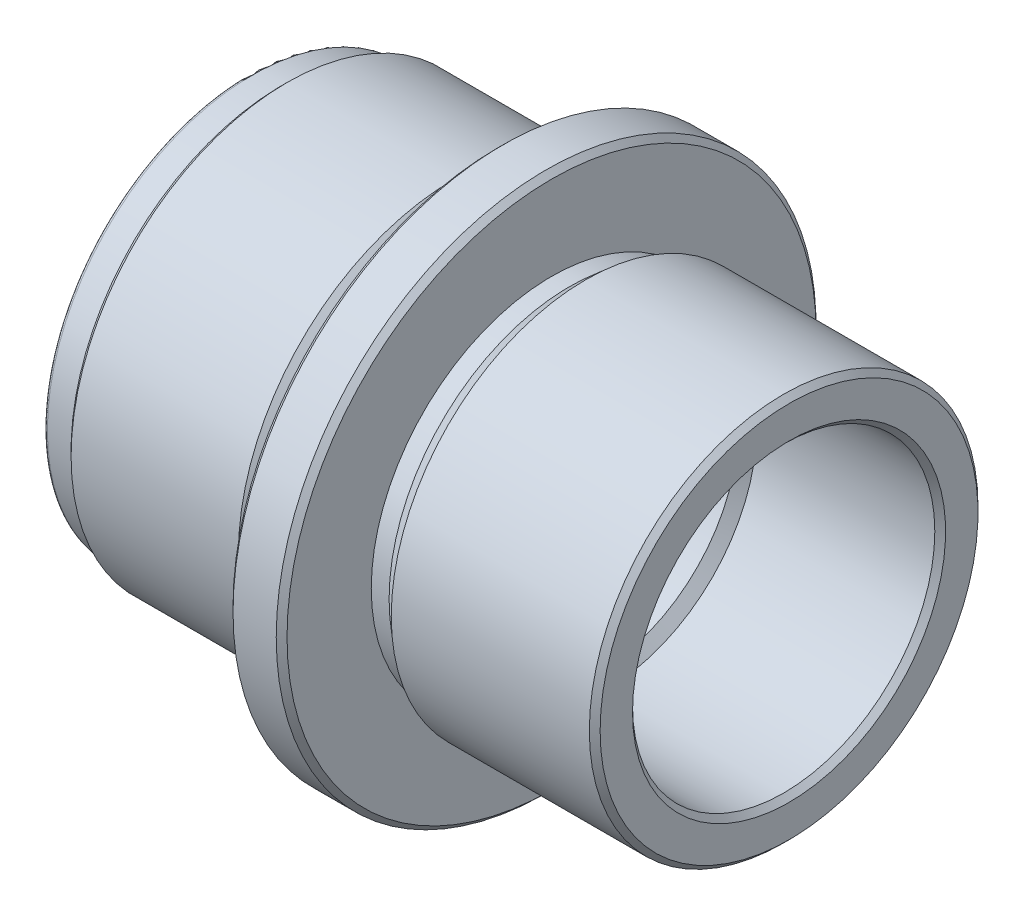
ISO-10303-21;
HEADER;
FILE_DESCRIPTION(('STEP AP214'),'2;1');
FILE_NAME('part.step','',(''),(''),'','','');
FILE_SCHEMA(('AUTOMOTIVE_DESIGN { 1 0 10303 214 1 1 1 1 }'));
ENDSEC;
DATA;
#1=APPLICATION_CONTEXT('core data for automotive mechanical design processes');
#2=APPLICATION_PROTOCOL_DEFINITION('international standard','automotive_design',2000,#1);
#3=PRODUCT_CONTEXT('',#1,'mechanical');
#4=PRODUCT('Part','Part','',(#3));
#5=PRODUCT_RELATED_PRODUCT_CATEGORY('part','',(#4));
#6=PRODUCT_DEFINITION_FORMATION('','',#4);
#7=PRODUCT_DEFINITION_CONTEXT('part definition',#1,'design');
#8=PRODUCT_DEFINITION('design','',#6,#7);
#9=PRODUCT_DEFINITION_SHAPE('','',#8);
#10=(LENGTH_UNIT() NAMED_UNIT(*) SI_UNIT(.MILLI.,.METRE.));
#11=(NAMED_UNIT(*) PLANE_ANGLE_UNIT() SI_UNIT($,.RADIAN.));
#12=(NAMED_UNIT(*) SI_UNIT($,.STERADIAN.) SOLID_ANGLE_UNIT());
#13=UNCERTAINTY_MEASURE_WITH_UNIT(LENGTH_MEASURE(1.E-05),#10,'distance_accuracy_value','');
#14=(GEOMETRIC_REPRESENTATION_CONTEXT(3) GLOBAL_UNCERTAINTY_ASSIGNED_CONTEXT((#13)) GLOBAL_UNIT_ASSIGNED_CONTEXT((#10,
#11,#12)) REPRESENTATION_CONTEXT('',''));
#15=CARTESIAN_POINT('',(0.,0.,0.));
#16=DIRECTION('',(0.,0.,1.));
#17=DIRECTION('',(1.,0.,0.));
#18=AXIS2_PLACEMENT_3D('',#15,#16,#17);
#19=CARTESIAN_POINT('',(0.,0.,0.));
#20=DIRECTION('',(-1.,0.,0.));
#21=DIRECTION('',(0.,0.,1.));
#22=AXIS2_PLACEMENT_3D('',#19,#20,#21);
#23=CYLINDRICAL_SURFACE('',#22,35.5600000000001);
#24=CARTESIAN_POINT('',(1.27000000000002,0.,0.));
#25=DIRECTION('',(1.,0.,0.));
#26=DIRECTION('',(0.,0.,-1.));
#27=AXIS2_PLACEMENT_3D('',#24,#25,#26);
#28=CIRCLE('',#27,35.5600000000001);
#29=CARTESIAN_POINT('',(1.27000000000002,0.,-35.5600000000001));
#30=VERTEX_POINT('',#29);
#31=EDGE_CURVE('E76',#30,#30,#28,.F.);
#32=ORIENTED_EDGE('',*,*,#31,.T.);
#33=EDGE_LOOP('',(#32));
#34=FACE_BOUND('',#33,.T.);
#35=CARTESIAN_POINT('',(10.16,0.,0.));
#36=DIRECTION('',(-1.,0.,0.));
#37=DIRECTION('',(0.,0.,1.));
#38=AXIS2_PLACEMENT_3D('',#35,#36,#37);
#39=CIRCLE('',#38,35.5600000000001);
#40=CARTESIAN_POINT('',(10.16,0.,35.5600000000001));
#41=VERTEX_POINT('',#40);
#42=EDGE_CURVE('E148',#41,#41,#39,.T.);
#43=ORIENTED_EDGE('',*,*,#42,.F.);
#44=EDGE_LOOP('',(#43));
#45=FACE_BOUND('',#44,.T.);
#46=ADVANCED_FACE('F49',(#34,#45),#23,.F.);
#47=CARTESIAN_POINT('',(0.,35.5600000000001,0.));
#48=DIRECTION('',(1.,0.,0.));
#49=DIRECTION('',(0.,0.,-1.));
#50=AXIS2_PLACEMENT_3D('',#47,#48,#49);
#51=PLANE('',#50);
#52=CARTESIAN_POINT('',(0.,0.,0.));
#53=DIRECTION('',(1.,0.,0.));
#54=DIRECTION('',(0.,0.,-1.));
#55=AXIS2_PLACEMENT_3D('',#52,#53,#54);
#56=CIRCLE('',#55,47.498);
#57=CARTESIAN_POINT('',(0.,0.,-47.498));
#58=VERTEX_POINT('',#57);
#59=EDGE_CURVE('E57',#58,#58,#56,.F.);
#60=ORIENTED_EDGE('',*,*,#59,.T.);
#61=EDGE_LOOP('',(#60));
#62=FACE_BOUND('',#61,.T.);
#63=CARTESIAN_POINT('',(0.,0.,0.));
#64=DIRECTION('',(1.,0.,0.));
#65=DIRECTION('',(0.,0.,-1.));
#66=AXIS2_PLACEMENT_3D('',#63,#64,#65);
#67=CIRCLE('',#66,36.8300000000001);
#68=CARTESIAN_POINT('',(0.,0.,-36.8300000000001));
#69=VERTEX_POINT('',#68);
#70=EDGE_CURVE('E73',#69,#69,#67,.T.);
#71=ORIENTED_EDGE('',*,*,#70,.T.);
#72=EDGE_LOOP('',(#71));
#73=FACE_BOUND('',#72,.T.);
#74=ADVANCED_FACE('F155',(#62,#73),#51,.F.);
#75=CARTESIAN_POINT('',(0.,0.,0.));
#76=DIRECTION('',(-1.,0.,0.));
#77=DIRECTION('',(0.,0.,1.));
#78=AXIS2_PLACEMENT_3D('',#75,#76,#77);
#79=CYLINDRICAL_SURFACE('',#78,48.26);
#80=CARTESIAN_POINT('',(0.762,0.,0.));
#81=DIRECTION('',(1.,0.,0.));
#82=DIRECTION('',(0.,0.,-1.));
#83=AXIS2_PLACEMENT_3D('',#80,#81,#82);
#84=CIRCLE('',#83,48.26);
#85=CARTESIAN_POINT('',(0.762,0.,-48.26));
#86=VERTEX_POINT('',#85);
#87=EDGE_CURVE('E12',#86,#86,#84,.T.);
#88=ORIENTED_EDGE('',*,*,#87,.T.);
#89=EDGE_LOOP('',(#88));
#90=FACE_BOUND('',#89,.T.);
#91=CARTESIAN_POINT('',(7.62,0.,0.));
#92=DIRECTION('',(-1.,0.,0.));
#93=DIRECTION('',(0.,0.,1.));
#94=AXIS2_PLACEMENT_3D('',#91,#92,#93);
#95=CIRCLE('',#94,48.26);
#96=CARTESIAN_POINT('',(7.62,0.,48.26));
#97=VERTEX_POINT('',#96);
#98=EDGE_CURVE('E109',#97,#97,#95,.T.);
#99=ORIENTED_EDGE('',*,*,#98,.T.);
#100=EDGE_LOOP('',(#99));
#101=FACE_BOUND('',#100,.T.);
#102=ADVANCED_FACE('F160',(#90,#101),#79,.T.);
#103=CARTESIAN_POINT('',(7.62,48.26,0.));
#104=DIRECTION('',(1.,0.,0.));
#105=DIRECTION('',(0.,0.,-1.));
#106=AXIS2_PLACEMENT_3D('',#103,#104,#105);
#107=PLANE('',#106);
#108=CARTESIAN_POINT('',(7.62,0.,0.));
#109=DIRECTION('',(1.,0.,0.));
#110=DIRECTION('',(0.,0.,-1.));
#111=AXIS2_PLACEMENT_3D('',#108,#109,#110);
#112=CIRCLE('',#111,49.53);
#113=CARTESIAN_POINT('',(7.62,0.,-49.53));
#114=VERTEX_POINT('',#113);
#115=EDGE_CURVE('E106',#114,#114,#112,.F.);
#116=ORIENTED_EDGE('',*,*,#115,.T.);
#117=EDGE_LOOP('',(#116));
#118=FACE_BOUND('',#117,.T.);
#119=ORIENTED_EDGE('',*,*,#98,.F.);
#120=EDGE_LOOP('',(#119));
#121=FACE_BOUND('',#120,.T.);
#122=ADVANCED_FACE('F267',(#118,#121),#107,.F.);
#123=CARTESIAN_POINT('',(0.,0.,0.));
#124=DIRECTION('',(-1.,0.,0.));
#125=DIRECTION('',(0.,0.,1.));
#126=AXIS2_PLACEMENT_3D('',#123,#124,#125);
#127=CYLINDRICAL_SURFACE('',#126,50.8);
#128=CARTESIAN_POINT('',(8.89000000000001,0.,0.));
#129=DIRECTION('',(1.,0.,0.));
#130=DIRECTION('',(0.,0.,-1.));
#131=AXIS2_PLACEMENT_3D('',#128,#129,#130);
#132=CIRCLE('',#131,50.8);
#133=CARTESIAN_POINT('',(8.89000000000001,0.,-50.8));
#134=VERTEX_POINT('',#133);
#135=EDGE_CURVE('E103',#134,#134,#132,.T.);
#136=ORIENTED_EDGE('',*,*,#135,.T.);
#137=EDGE_LOOP('',(#136));
#138=FACE_BOUND('',#137,.T.);
#139=CARTESIAN_POINT('',(48.26,0.,0.));
#140=DIRECTION('',(-1.,0.,0.));
#141=DIRECTION('',(0.,0.,1.));
#142=AXIS2_PLACEMENT_3D('',#139,#140,#141);
#143=CIRCLE('',#142,50.8);
#144=CARTESIAN_POINT('',(48.26,0.,50.8));
#145=VERTEX_POINT('',#144);
#146=EDGE_CURVE('E112',#145,#145,#143,.T.);
#147=ORIENTED_EDGE('',*,*,#146,.T.);
#148=EDGE_LOOP('',(#147));
#149=FACE_BOUND('',#148,.T.);
#150=ADVANCED_FACE('F263',(#138,#149),#127,.T.);
#151=CARTESIAN_POINT('',(50.8,0.,0.));
#152=DIRECTION('',(-1.,0.,0.));
#153=DIRECTION('',(0.,0.,1.));
#154=AXIS2_PLACEMENT_3D('',#151,#152,#153);
#155=CONICAL_SURFACE('',#154,48.26,0.785398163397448);
#156=ORIENTED_EDGE('',*,*,#146,.F.);
#157=EDGE_LOOP('',(#156));
#158=FACE_BOUND('',#157,.T.);
#159=CARTESIAN_POINT('',(50.8,0.,0.));
#160=DIRECTION('',(-1.,0.,0.));
#161=DIRECTION('',(0.,0.,1.));
#162=AXIS2_PLACEMENT_3D('',#159,#160,#161);
#163=CIRCLE('',#162,48.26);
#164=CARTESIAN_POINT('',(50.8,0.,48.26));
#165=VERTEX_POINT('',#164);
#166=EDGE_CURVE('E115',#165,#165,#163,.T.);
#167=ORIENTED_EDGE('',*,*,#166,.T.);
#168=EDGE_LOOP('',(#167));
#169=FACE_BOUND('',#168,.T.);
#170=ADVANCED_FACE('F259',(#158,#169),#155,.T.);
#171=CARTESIAN_POINT('',(0.,0.,0.));
#172=DIRECTION('',(-1.,0.,0.));
#173=DIRECTION('',(0.,0.,1.));
#174=AXIS2_PLACEMENT_3D('',#171,#172,#173);
#175=CYLINDRICAL_SURFACE('',#174,48.26);
#176=ORIENTED_EDGE('',*,*,#166,.F.);
#177=EDGE_LOOP('',(#176));
#178=FACE_BOUND('',#177,.T.);
#179=CARTESIAN_POINT('',(58.42,0.,0.));
#180=DIRECTION('',(-1.,0.,0.));
#181=DIRECTION('',(0.,0.,1.));
#182=AXIS2_PLACEMENT_3D('',#179,#180,#181);
#183=CIRCLE('',#182,48.26);
#184=CARTESIAN_POINT('',(58.42,0.,48.26));
#185=VERTEX_POINT('',#184);
#186=EDGE_CURVE('E118',#185,#185,#183,.T.);
#187=ORIENTED_EDGE('',*,*,#186,.T.);
#188=EDGE_LOOP('',(#187));
#189=FACE_BOUND('',#188,.T.);
#190=ADVANCED_FACE('F255',(#178,#189),#175,.T.);
#191=CARTESIAN_POINT('',(58.42,48.26,0.));
#192=DIRECTION('',(1.,0.,0.));
#193=DIRECTION('',(0.,0.,-1.));
#194=AXIS2_PLACEMENT_3D('',#191,#192,#193);
#195=PLANE('',#194);
#196=CARTESIAN_POINT('',(58.42,0.,0.));
#197=DIRECTION('',(1.,0.,0.));
#198=DIRECTION('',(0.,0.,-1.));
#199=AXIS2_PLACEMENT_3D('',#196,#197,#198);
#200=CIRCLE('',#199,62.23);
#201=CARTESIAN_POINT('',(58.42,0.,-62.23));
#202=VERTEX_POINT('',#201);
#203=EDGE_CURVE('E100',#202,#202,#200,.F.);
#204=ORIENTED_EDGE('',*,*,#203,.T.);
#205=EDGE_LOOP('',(#204));
#206=FACE_BOUND('',#205,.T.);
#207=ORIENTED_EDGE('',*,*,#186,.F.);
#208=EDGE_LOOP('',(#207));
#209=FACE_BOUND('',#208,.T.);
#210=ADVANCED_FACE('F251',(#206,#209),#195,.F.);
#211=CARTESIAN_POINT('',(0.,0.,0.));
#212=DIRECTION('',(-1.,0.,0.));
#213=DIRECTION('',(0.,0.,1.));
#214=AXIS2_PLACEMENT_3D('',#211,#212,#213);
#215=CYLINDRICAL_SURFACE('',#214,63.5);
#216=CARTESIAN_POINT('',(59.69,0.,0.));
#217=DIRECTION('',(1.,0.,0.));
#218=DIRECTION('',(0.,0.,-1.));
#219=AXIS2_PLACEMENT_3D('',#216,#217,#218);
#220=CIRCLE('',#219,63.5);
#221=CARTESIAN_POINT('',(59.69,0.,-63.5));
#222=VERTEX_POINT('',#221);
#223=EDGE_CURVE('E94',#222,#222,#220,.T.);
#224=ORIENTED_EDGE('',*,*,#223,.T.);
#225=EDGE_LOOP('',(#224));
#226=FACE_BOUND('',#225,.T.);
#227=CARTESIAN_POINT('',(69.8499999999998,0.,0.));
#228=DIRECTION('',(-1.,0.,0.));
#229=DIRECTION('',(0.,0.,1.));
#230=AXIS2_PLACEMENT_3D('',#227,#228,#229);
#231=CIRCLE('',#230,63.5);
#232=CARTESIAN_POINT('',(69.8499999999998,0.,63.5));
#233=VERTEX_POINT('',#232);
#234=EDGE_CURVE('E97',#233,#233,#231,.T.);
#235=ORIENTED_EDGE('',*,*,#234,.T.);
#236=EDGE_LOOP('',(#235));
#237=FACE_BOUND('',#236,.T.);
#238=ADVANCED_FACE('F247',(#226,#237),#215,.T.);
#239=CARTESIAN_POINT('',(71.1199999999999,63.5,0.));
#240=DIRECTION('',(-1.,0.,0.));
#241=DIRECTION('',(0.,0.,1.));
#242=AXIS2_PLACEMENT_3D('',#239,#240,#241);
#243=PLANE('',#242);
#244=CARTESIAN_POINT('',(71.1199999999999,0.,0.));
#245=DIRECTION('',(-1.,0.,0.));
#246=DIRECTION('',(0.,0.,1.));
#247=AXIS2_PLACEMENT_3D('',#244,#245,#246);
#248=CIRCLE('',#247,62.23);
#249=CARTESIAN_POINT('',(71.1199999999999,0.,62.23));
#250=VERTEX_POINT('',#249);
#251=EDGE_CURVE('E91',#250,#250,#248,.F.);
#252=ORIENTED_EDGE('',*,*,#251,.T.);
#253=EDGE_LOOP('',(#252));
#254=FACE_BOUND('',#253,.T.);
#255=CARTESIAN_POINT('',(71.1199999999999,0.,0.));
#256=DIRECTION('',(-1.,0.,0.));
#257=DIRECTION('',(0.,0.,1.));
#258=AXIS2_PLACEMENT_3D('',#255,#256,#257);
#259=CIRCLE('',#258,42.4161080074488);
#260=CARTESIAN_POINT('',(71.1199999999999,0.,42.4161080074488));
#261=VERTEX_POINT('',#260);
#262=EDGE_CURVE('E121',#261,#261,#259,.T.);
#263=ORIENTED_EDGE('',*,*,#262,.T.);
#264=EDGE_LOOP('',(#263));
#265=FACE_BOUND('',#264,.T.);
#266=ADVANCED_FACE('F243',(#254,#265),#243,.F.);
#267=CARTESIAN_POINT('',(0.,0.,0.));
#268=DIRECTION('',(-1.,0.,0.));
#269=DIRECTION('',(0.,0.,1.));
#270=AXIS2_PLACEMENT_3D('',#267,#268,#269);
#271=CYLINDRICAL_SURFACE('',#270,42.4161080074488);
#272=ORIENTED_EDGE('',*,*,#262,.F.);
#273=EDGE_LOOP('',(#272));
#274=FACE_BOUND('',#273,.T.);
#275=CARTESIAN_POINT('',(75.319090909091,0.,0.));
#276=DIRECTION('',(-1.,0.,0.));
#277=DIRECTION('',(0.,0.,1.));
#278=AXIS2_PLACEMENT_3D('',#275,#276,#277);
#279=CIRCLE('',#278,42.4161080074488);
#280=CARTESIAN_POINT('',(75.319090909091,0.,42.4161080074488));
#281=VERTEX_POINT('',#280);
#282=EDGE_CURVE('E124',#281,#281,#279,.T.);
#283=ORIENTED_EDGE('',*,*,#282,.T.);
#284=EDGE_LOOP('',(#283));
#285=FACE_BOUND('',#284,.T.);
#286=ADVANCED_FACE('F239',(#274,#285),#271,.T.);
#287=CARTESIAN_POINT('',(79.1290909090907,0.,0.));
#288=DIRECTION('',(1.,0.,0.));
#289=DIRECTION('',(0.,0.,-1.));
#290=AXIS2_PLACEMENT_3D('',#287,#288,#289);
#291=CONICAL_SURFACE('',#290,45.72,0.714374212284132);
#292=ORIENTED_EDGE('',*,*,#282,.F.);
#293=EDGE_LOOP('',(#292));
#294=FACE_BOUND('',#293,.T.);
#295=CARTESIAN_POINT('',(79.1290909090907,0.,0.));
#296=DIRECTION('',(-1.,0.,0.));
#297=DIRECTION('',(0.,0.,1.));
#298=AXIS2_PLACEMENT_3D('',#295,#296,#297);
#299=CIRCLE('',#298,45.72);
#300=CARTESIAN_POINT('',(79.1290909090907,0.,45.72));
#301=VERTEX_POINT('',#300);
#302=EDGE_CURVE('E127',#301,#301,#299,.T.);
#303=ORIENTED_EDGE('',*,*,#302,.T.);
#304=EDGE_LOOP('',(#303));
#305=FACE_BOUND('',#304,.T.);
#306=ADVANCED_FACE('F235',(#294,#305),#291,.T.);
#307=CARTESIAN_POINT('',(0.,0.,0.));
#308=DIRECTION('',(-1.,0.,0.));
#309=DIRECTION('',(0.,0.,1.));
#310=AXIS2_PLACEMENT_3D('',#307,#308,#309);
#311=CYLINDRICAL_SURFACE('',#310,45.72);
#312=CARTESIAN_POINT('',(125.73,0.,0.));
#313=DIRECTION('',(-1.,0.,0.));
#314=DIRECTION('',(0.,0.,1.));
#315=AXIS2_PLACEMENT_3D('',#312,#313,#314);
#316=CIRCLE('',#315,45.72);
#317=CARTESIAN_POINT('',(125.73,0.,45.72));
#318=VERTEX_POINT('',#317);
#319=EDGE_CURVE('E88',#318,#318,#316,.T.);
#320=ORIENTED_EDGE('',*,*,#319,.T.);
#321=EDGE_LOOP('',(#320));
#322=FACE_BOUND('',#321,.T.);
#323=ORIENTED_EDGE('',*,*,#302,.F.);
#324=EDGE_LOOP('',(#323));
#325=FACE_BOUND('',#324,.T.);
#326=ADVANCED_FACE('F231',(#322,#325),#311,.T.);
#327=CARTESIAN_POINT('',(127.,45.72,0.));
#328=DIRECTION('',(-1.,0.,0.));
#329=DIRECTION('',(0.,0.,1.));
#330=AXIS2_PLACEMENT_3D('',#327,#328,#329);
#331=PLANE('',#330);
#332=CARTESIAN_POINT('',(127.,0.,0.));
#333=DIRECTION('',(-1.,0.,0.));
#334=DIRECTION('',(0.,0.,1.));
#335=AXIS2_PLACEMENT_3D('',#332,#333,#334);
#336=CIRCLE('',#335,44.45);
#337=CARTESIAN_POINT('',(127.,0.,44.45));
#338=VERTEX_POINT('',#337);
#339=EDGE_CURVE('E82',#338,#338,#336,.F.);
#340=ORIENTED_EDGE('',*,*,#339,.T.);
#341=EDGE_LOOP('',(#340));
#342=FACE_BOUND('',#341,.T.);
#343=CARTESIAN_POINT('',(127.,0.,0.));
#344=DIRECTION('',(-1.,0.,0.));
#345=DIRECTION('',(0.,0.,1.));
#346=AXIS2_PLACEMENT_3D('',#343,#344,#345);
#347=CIRCLE('',#346,36.8300000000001);
#348=CARTESIAN_POINT('',(127.,0.,36.8300000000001));
#349=VERTEX_POINT('',#348);
#350=EDGE_CURVE('E85',#349,#349,#347,.T.);
#351=ORIENTED_EDGE('',*,*,#350,.T.);
#352=EDGE_LOOP('',(#351));
#353=FACE_BOUND('',#352,.T.);
#354=ADVANCED_FACE('F227',(#342,#353),#331,.F.);
#355=CARTESIAN_POINT('',(0.,0.,0.));
#356=DIRECTION('',(-1.,0.,0.));
#357=DIRECTION('',(0.,0.,1.));
#358=AXIS2_PLACEMENT_3D('',#355,#356,#357);
#359=CYLINDRICAL_SURFACE('',#358,35.5600000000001);
#360=CARTESIAN_POINT('',(125.73,0.,0.));
#361=DIRECTION('',(-1.,0.,0.));
#362=DIRECTION('',(0.,0.,1.));
#363=AXIS2_PLACEMENT_3D('',#360,#361,#362);
#364=CIRCLE('',#363,35.5600000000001);
#365=CARTESIAN_POINT('',(125.73,0.,35.5600000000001));
#366=VERTEX_POINT('',#365);
#367=EDGE_CURVE('E79',#366,#366,#364,.F.);
#368=ORIENTED_EDGE('',*,*,#367,.T.);
#369=EDGE_LOOP('',(#368));
#370=FACE_BOUND('',#369,.T.);
#371=CARTESIAN_POINT('',(83.8200000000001,0.,0.));
#372=DIRECTION('',(-1.,0.,0.));
#373=DIRECTION('',(0.,0.,1.));
#374=AXIS2_PLACEMENT_3D('',#371,#372,#373);
#375=CIRCLE('',#374,35.5600000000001);
#376=CARTESIAN_POINT('',(83.8200000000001,0.,35.5600000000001));
#377=VERTEX_POINT('',#376);
#378=EDGE_CURVE('E130',#377,#377,#375,.T.);
#379=ORIENTED_EDGE('',*,*,#378,.T.);
#380=EDGE_LOOP('',(#379));
#381=FACE_BOUND('',#380,.T.);
#382=ADVANCED_FACE('F223',(#370,#381),#359,.F.);
#383=CARTESIAN_POINT('',(81.915,0.,0.));
#384=DIRECTION('',(1.,0.,0.));
#385=DIRECTION('',(0.,0.,-1.));
#386=AXIS2_PLACEMENT_3D('',#383,#384,#385);
#387=CONICAL_SURFACE('',#386,33.0200000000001,0.927295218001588);
#388=ORIENTED_EDGE('',*,*,#378,.F.);
#389=EDGE_LOOP('',(#388));
#390=FACE_BOUND('',#389,.T.);
#391=CARTESIAN_POINT('',(81.915,0.,0.));
#392=DIRECTION('',(-1.,0.,0.));
#393=DIRECTION('',(0.,0.,1.));
#394=AXIS2_PLACEMENT_3D('',#391,#392,#393);
#395=CIRCLE('',#394,33.0200000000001);
#396=CARTESIAN_POINT('',(81.915,0.,33.0200000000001));
#397=VERTEX_POINT('',#396);
#398=EDGE_CURVE('E133',#397,#397,#395,.T.);
#399=ORIENTED_EDGE('',*,*,#398,.T.);
#400=EDGE_LOOP('',(#399));
#401=FACE_BOUND('',#400,.T.);
#402=ADVANCED_FACE('F219',(#390,#401),#387,.F.);
#403=CARTESIAN_POINT('',(0.,0.,0.));
#404=DIRECTION('',(-1.,0.,0.));
#405=DIRECTION('',(0.,0.,1.));
#406=AXIS2_PLACEMENT_3D('',#403,#404,#405);
#407=CYLINDRICAL_SURFACE('',#406,33.0200000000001);
#408=ORIENTED_EDGE('',*,*,#398,.F.);
#409=EDGE_LOOP('',(#408));
#410=FACE_BOUND('',#409,.T.);
#411=CARTESIAN_POINT('',(63.5,0.,0.));
#412=DIRECTION('',(-1.,0.,0.));
#413=DIRECTION('',(0.,0.,1.));
#414=AXIS2_PLACEMENT_3D('',#411,#412,#413);
#415=CIRCLE('',#414,33.0200000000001);
#416=CARTESIAN_POINT('',(63.5,0.,33.0200000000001));
#417=VERTEX_POINT('',#416);
#418=EDGE_CURVE('E136',#417,#417,#415,.T.);
#419=ORIENTED_EDGE('',*,*,#418,.T.);
#420=EDGE_LOOP('',(#419));
#421=FACE_BOUND('',#420,.T.);
#422=ADVANCED_FACE('F215',(#410,#421),#407,.F.);
#423=CARTESIAN_POINT('',(63.5,33.0200000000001,0.));
#424=DIRECTION('',(-1.,0.,0.));
#425=DIRECTION('',(0.,0.,1.));
#426=AXIS2_PLACEMENT_3D('',#423,#424,#425);
#427=PLANE('',#426);
#428=ORIENTED_EDGE('',*,*,#418,.F.);
#429=EDGE_LOOP('',(#428));
#430=FACE_BOUND('',#429,.T.);
#431=CARTESIAN_POINT('',(63.5,0.,0.));
#432=DIRECTION('',(-1.,0.,0.));
#433=DIRECTION('',(0.,0.,1.));
#434=AXIS2_PLACEMENT_3D('',#431,#432,#433);
#435=CIRCLE('',#434,30.4800000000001);
#436=CARTESIAN_POINT('',(63.5,0.,30.4800000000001));
#437=VERTEX_POINT('',#436);
#438=EDGE_CURVE('E139',#437,#437,#435,.T.);
#439=ORIENTED_EDGE('',*,*,#438,.T.);
#440=EDGE_LOOP('',(#439));
#441=FACE_BOUND('',#440,.T.);
#442=ADVANCED_FACE('F211',(#430,#441),#427,.F.);
#443=CARTESIAN_POINT('',(0.,0.,0.));
#444=DIRECTION('',(-1.,0.,0.));
#445=DIRECTION('',(0.,0.,1.));
#446=AXIS2_PLACEMENT_3D('',#443,#444,#445);
#447=CYLINDRICAL_SURFACE('',#446,30.4800000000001);
#448=CARTESIAN_POINT('',(39.37,0.,0.));
#449=DIRECTION('',(1.,0.,0.));
#450=DIRECTION('',(0.,0.,-1.));
#451=AXIS2_PLACEMENT_3D('',#448,#449,#450);
#452=CIRCLE('',#451,30.4800000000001);
#453=CARTESIAN_POINT('',(39.37,0.,-30.4800000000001));
#454=VERTEX_POINT('',#453);
#455=EDGE_CURVE('E68',#454,#454,#452,.F.);
#456=ORIENTED_EDGE('',*,*,#455,.T.);
#457=EDGE_LOOP('',(#456));
#458=FACE_BOUND('',#457,.T.);
#459=ORIENTED_EDGE('',*,*,#438,.F.);
#460=EDGE_LOOP('',(#459));
#461=FACE_BOUND('',#460,.T.);
#462=ADVANCED_FACE('F207',(#458,#461),#447,.F.);
#463=CARTESIAN_POINT('',(38.1,30.4800000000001,0.));
#464=DIRECTION('',(1.,0.,0.));
#465=DIRECTION('',(0.,0.,-1.));
#466=AXIS2_PLACEMENT_3D('',#463,#464,#465);
#467=PLANE('',#466);
#468=CARTESIAN_POINT('',(38.1,0.,0.));
#469=DIRECTION('',(1.,0.,0.));
#470=DIRECTION('',(0.,0.,-1.));
#471=AXIS2_PLACEMENT_3D('',#468,#469,#470);
#472=CIRCLE('',#471,31.7500000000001);
#473=CARTESIAN_POINT('',(38.1,0.,-31.7500000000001));
#474=VERTEX_POINT('',#473);
#475=EDGE_CURVE('E64',#474,#474,#472,.T.);
#476=ORIENTED_EDGE('',*,*,#475,.T.);
#477=EDGE_LOOP('',(#476));
#478=FACE_BOUND('',#477,.T.);
#479=CARTESIAN_POINT('',(38.1,0.,0.));
#480=DIRECTION('',(-1.,0.,0.));
#481=DIRECTION('',(0.,0.,1.));
#482=AXIS2_PLACEMENT_3D('',#479,#480,#481);
#483=CIRCLE('',#482,38.1000000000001);
#484=CARTESIAN_POINT('',(38.1,0.,38.1000000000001));
#485=VERTEX_POINT('',#484);
#486=EDGE_CURVE('E142',#485,#485,#483,.T.);
#487=ORIENTED_EDGE('',*,*,#486,.T.);
#488=EDGE_LOOP('',(#487));
#489=FACE_BOUND('',#488,.T.);
#490=ADVANCED_FACE('F203',(#478,#489),#467,.F.);
#491=CARTESIAN_POINT('',(0.,0.,0.));
#492=DIRECTION('',(-1.,0.,0.));
#493=DIRECTION('',(0.,0.,1.));
#494=AXIS2_PLACEMENT_3D('',#491,#492,#493);
#495=CYLINDRICAL_SURFACE('',#494,38.1000000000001);
#496=ORIENTED_EDGE('',*,*,#486,.F.);
#497=EDGE_LOOP('',(#496));
#498=FACE_BOUND('',#497,.T.);
#499=CARTESIAN_POINT('',(10.16,0.,0.));
#500=DIRECTION('',(-1.,0.,0.));
#501=DIRECTION('',(0.,0.,1.));
#502=AXIS2_PLACEMENT_3D('',#499,#500,#501);
#503=CIRCLE('',#502,38.1000000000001);
#504=CARTESIAN_POINT('',(10.16,0.,38.1000000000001));
#505=VERTEX_POINT('',#504);
#506=EDGE_CURVE('E145',#505,#505,#503,.T.);
#507=ORIENTED_EDGE('',*,*,#506,.T.);
#508=EDGE_LOOP('',(#507));
#509=FACE_BOUND('',#508,.T.);
#510=ADVANCED_FACE('F199',(#498,#509),#495,.F.);
#511=CARTESIAN_POINT('',(10.16,38.1000000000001,0.));
#512=DIRECTION('',(-1.,0.,0.));
#513=DIRECTION('',(0.,0.,1.));
#514=AXIS2_PLACEMENT_3D('',#511,#512,#513);
#515=PLANE('',#514);
#516=ORIENTED_EDGE('',*,*,#506,.F.);
#517=EDGE_LOOP('',(#516));
#518=FACE_BOUND('',#517,.T.);
#519=ORIENTED_EDGE('',*,*,#42,.T.);
#520=EDGE_LOOP('',(#519));
#521=FACE_BOUND('',#520,.T.);
#522=ADVANCED_FACE('F152',(#518,#521),#515,.F.);
#523=CARTESIAN_POINT('',(7.62,0.,0.));
#524=DIRECTION('',(1.,0.,0.));
#525=DIRECTION('',(0.,0.,-1.));
#526=AXIS2_PLACEMENT_3D('',#523,#524,#525);
#527=CONICAL_SURFACE('',#526,49.53,0.785398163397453);
#528=ORIENTED_EDGE('',*,*,#135,.F.);
#529=EDGE_LOOP('',(#528));
#530=FACE_BOUND('',#529,.T.);
#531=ORIENTED_EDGE('',*,*,#115,.F.);
#532=EDGE_LOOP('',(#531));
#533=FACE_BOUND('',#532,.T.);
#534=ADVANCED_FACE('F192',(#530,#533),#527,.T.);
#535=CARTESIAN_POINT('',(58.42,0.,0.));
#536=DIRECTION('',(1.,0.,0.));
#537=DIRECTION('',(0.,0.,-1.));
#538=AXIS2_PLACEMENT_3D('',#535,#536,#537);
#539=CONICAL_SURFACE('',#538,62.23,0.785398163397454);
#540=ORIENTED_EDGE('',*,*,#223,.F.);
#541=EDGE_LOOP('',(#540));
#542=FACE_BOUND('',#541,.T.);
#543=ORIENTED_EDGE('',*,*,#203,.F.);
#544=EDGE_LOOP('',(#543));
#545=FACE_BOUND('',#544,.T.);
#546=ADVANCED_FACE('F188',(#542,#545),#539,.T.);
#547=CARTESIAN_POINT('',(69.8499999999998,0.,0.));
#548=DIRECTION('',(-1.,0.,0.));
#549=DIRECTION('',(0.,0.,1.));
#550=AXIS2_PLACEMENT_3D('',#547,#548,#549);
#551=CONICAL_SURFACE('',#550,63.5,0.785398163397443);
#552=ORIENTED_EDGE('',*,*,#251,.F.);
#553=EDGE_LOOP('',(#552));
#554=FACE_BOUND('',#553,.T.);
#555=ORIENTED_EDGE('',*,*,#234,.F.);
#556=EDGE_LOOP('',(#555));
#557=FACE_BOUND('',#556,.T.);
#558=ADVANCED_FACE('F184',(#554,#557),#551,.T.);
#559=CARTESIAN_POINT('',(125.73,0.,0.));
#560=DIRECTION('',(-1.,0.,0.));
#561=DIRECTION('',(0.,0.,1.));
#562=AXIS2_PLACEMENT_3D('',#559,#560,#561);
#563=CONICAL_SURFACE('',#562,45.72,0.785398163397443);
#564=ORIENTED_EDGE('',*,*,#339,.F.);
#565=EDGE_LOOP('',(#564));
#566=FACE_BOUND('',#565,.T.);
#567=ORIENTED_EDGE('',*,*,#319,.F.);
#568=EDGE_LOOP('',(#567));
#569=FACE_BOUND('',#568,.T.);
#570=ADVANCED_FACE('F176',(#566,#569),#563,.T.);
#571=CARTESIAN_POINT('',(127.,0.,0.));
#572=DIRECTION('',(1.,0.,0.));
#573=DIRECTION('',(0.,0.,-1.));
#574=AXIS2_PLACEMENT_3D('',#571,#572,#573);
#575=CONICAL_SURFACE('',#574,36.8300000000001,0.785398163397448);
#576=ORIENTED_EDGE('',*,*,#367,.F.);
#577=EDGE_LOOP('',(#576));
#578=FACE_BOUND('',#577,.T.);
#579=ORIENTED_EDGE('',*,*,#350,.F.);
#580=EDGE_LOOP('',(#579));
#581=FACE_BOUND('',#580,.T.);
#582=ADVANCED_FACE('F166',(#578,#581),#575,.F.);
#583=CARTESIAN_POINT('',(1.27000000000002,0.,0.));
#584=DIRECTION('',(-1.,0.,0.));
#585=DIRECTION('',(0.,0.,1.));
#586=AXIS2_PLACEMENT_3D('',#583,#584,#585);
#587=CONICAL_SURFACE('',#586,35.5600000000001,0.785398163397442);
#588=ORIENTED_EDGE('',*,*,#70,.F.);
#589=EDGE_LOOP('',(#588));
#590=FACE_BOUND('',#589,.T.);
#591=ORIENTED_EDGE('',*,*,#31,.F.);
#592=EDGE_LOOP('',(#591));
#593=FACE_BOUND('',#592,.T.);
#594=ADVANCED_FACE('F163',(#590,#593),#587,.F.);
#595=CARTESIAN_POINT('',(39.37,0.,0.));
#596=DIRECTION('',(-1.,0.,0.));
#597=DIRECTION('',(0.,0.,1.));
#598=AXIS2_PLACEMENT_3D('',#595,#596,#597);
#599=CONICAL_SURFACE('',#598,30.4800000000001,0.785398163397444);
#600=ORIENTED_EDGE('',*,*,#475,.F.);
#601=EDGE_LOOP('',(#600));
#602=FACE_BOUND('',#601,.T.);
#603=ORIENTED_EDGE('',*,*,#455,.F.);
#604=EDGE_LOOP('',(#603));
#605=FACE_BOUND('',#604,.T.);
#606=ADVANCED_FACE('F165',(#602,#605),#599,.F.);
#607=CARTESIAN_POINT('',(0.762,0.,0.));
#608=DIRECTION('',(1.,0.,0.));
#609=DIRECTION('',(0.,0.,-1.));
#610=AXIS2_PLACEMENT_3D('',#607,#608,#609);
#611=TOROIDAL_SURFACE('',#610,47.498,0.762);
#612=ORIENTED_EDGE('',*,*,#87,.F.);
#613=EDGE_LOOP('',(#612));
#614=FACE_BOUND('',#613,.T.);
#615=ORIENTED_EDGE('',*,*,#59,.F.);
#616=EDGE_LOOP('',(#615));
#617=FACE_BOUND('',#616,.T.);
#618=ADVANCED_FACE('F173',(#614,#617),#611,.T.);
#619=CLOSED_SHELL('',(#46,#74,#102,#122,#150,#170,#190,#210,#238,#266,#286,#306,#326,#354,#382,
#402,#422,#442,#462,#490,#510,#522,#534,#546,#558,#570,#582,#594,#606,#618));
#620=MANIFOLD_SOLID_BREP('B2',#619);
#621=ADVANCED_BREP_SHAPE_REPRESENTATION('',(#18,#620),#14);
#622=SHAPE_DEFINITION_REPRESENTATION(#9,#621);
ENDSEC;
END-ISO-10303-21;
